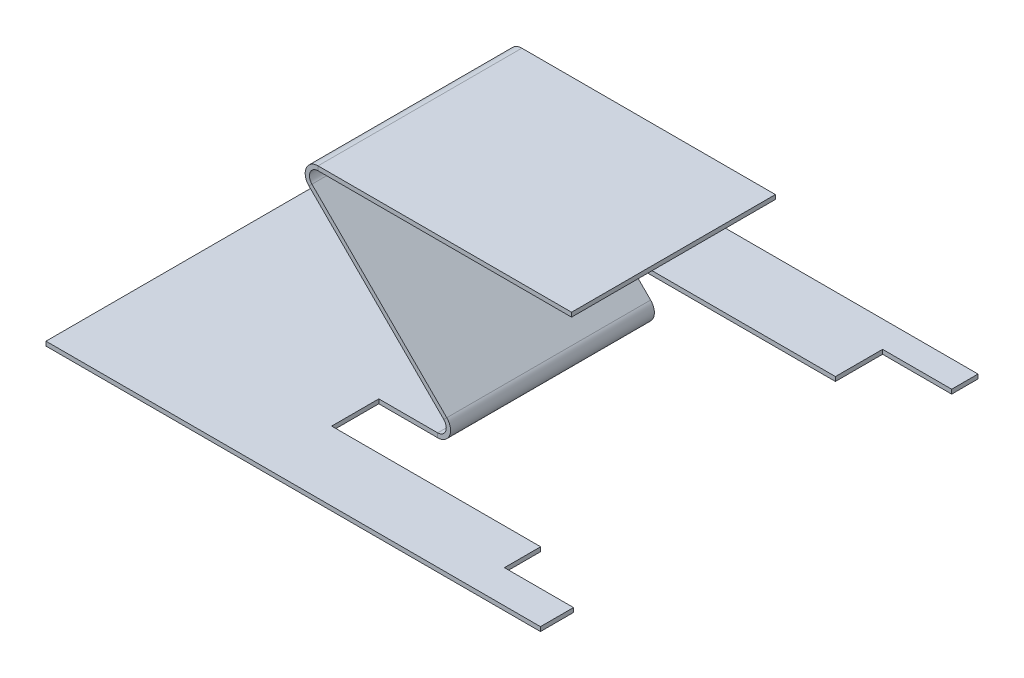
ISO-10303-21;
HEADER;
FILE_DESCRIPTION(('STEP AP214'),'2;1');
FILE_NAME('part.step','',(''),(''),'','','');
FILE_SCHEMA(('AUTOMOTIVE_DESIGN { 1 0 10303 214 1 1 1 1 }'));
ENDSEC;
DATA;
#1=APPLICATION_CONTEXT('core data for automotive mechanical design processes');
#2=APPLICATION_PROTOCOL_DEFINITION('international standard','automotive_design',2000,#1);
#3=PRODUCT_CONTEXT('',#1,'mechanical');
#4=PRODUCT('Part','Part','',(#3));
#5=PRODUCT_RELATED_PRODUCT_CATEGORY('part','',(#4));
#6=PRODUCT_DEFINITION_FORMATION('','',#4);
#7=PRODUCT_DEFINITION_CONTEXT('part definition',#1,'design');
#8=PRODUCT_DEFINITION('design','',#6,#7);
#9=PRODUCT_DEFINITION_SHAPE('','',#8);
#10=(LENGTH_UNIT() NAMED_UNIT(*) SI_UNIT(.MILLI.,.METRE.));
#11=(NAMED_UNIT(*) PLANE_ANGLE_UNIT() SI_UNIT($,.RADIAN.));
#12=(NAMED_UNIT(*) SI_UNIT($,.STERADIAN.) SOLID_ANGLE_UNIT());
#13=UNCERTAINTY_MEASURE_WITH_UNIT(LENGTH_MEASURE(1.E-05),#10,'distance_accuracy_value','');
#14=(GEOMETRIC_REPRESENTATION_CONTEXT(3) GLOBAL_UNCERTAINTY_ASSIGNED_CONTEXT((#13)) GLOBAL_UNIT_ASSIGNED_CONTEXT((#10,
#11,#12)) REPRESENTATION_CONTEXT('',''));
#15=CARTESIAN_POINT('',(0.,0.,0.));
#16=DIRECTION('',(0.,0.,1.));
#17=DIRECTION('',(1.,0.,0.));
#18=AXIS2_PLACEMENT_3D('',#15,#16,#17);
#19=CARTESIAN_POINT('',(24.2169050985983,36.4189178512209,41.4697311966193));
#20=DIRECTION('',(0.707106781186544,0.707106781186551,0.));
#21=DIRECTION('',(0.,0.,-1.));
#22=AXIS2_PLACEMENT_3D('',#19,#20,#21);
#23=PLANE('',#22);
#24=DIRECTION('',(-0.707106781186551,0.707106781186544,0.));
#25=VECTOR('',#24,1.);
#26=CARTESIAN_POINT('',(70.1039701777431,-9.46814722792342,22.0110102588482));
#27=LINE('',#26,#25);
#28=CARTESIAN_POINT('',(56.2216093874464,4.4142135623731,22.0110102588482));
#29=VERTEX_POINT('',#28);
#30=CARTESIAN_POINT('',(24.7571432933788,35.8786796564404,22.0110102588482));
#31=VERTEX_POINT('',#30);
#32=EDGE_CURVE('E43',#29,#31,#27,.T.);
#33=ORIENTED_EDGE('',*,*,#32,.T.);
#34=DIRECTION('',(0.,0.,-1.));
#35=VECTOR('',#34,1.);
#36=CARTESIAN_POINT('',(24.7571432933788,35.8786796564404,41.4697311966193));
#37=LINE('',#36,#35);
#38=CARTESIAN_POINT('',(24.7571432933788,35.8786796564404,-25.5547520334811));
#39=VERTEX_POINT('',#38);
#40=EDGE_CURVE('E398',#31,#39,#37,.T.);
#41=ORIENTED_EDGE('',*,*,#40,.T.);
#42=DIRECTION('',(0.707106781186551,-0.707106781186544,0.));
#43=VECTOR('',#42,1.);
#44=CARTESIAN_POINT('',(17.5497955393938,43.0860274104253,-25.5547520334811));
#45=LINE('',#44,#43);
#46=CARTESIAN_POINT('',(56.2216093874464,4.4142135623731,-25.5547520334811));
#47=VERTEX_POINT('',#46);
#48=EDGE_CURVE('E390',#39,#47,#45,.T.);
#49=ORIENTED_EDGE('',*,*,#48,.T.);
#50=DIRECTION('',(0.,0.,-1.));
#51=VECTOR('',#50,1.);
#52=CARTESIAN_POINT('',(56.2216093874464,4.41421356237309,41.4697311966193));
#53=LINE('',#52,#51);
#54=EDGE_CURVE('E386',#29,#47,#53,.T.);
#55=ORIENTED_EDGE('',*,*,#54,.F.);
#56=EDGE_LOOP('',(#33,#41,#49,#55));
#57=FACE_BOUND('',#56,.T.);
#58=ADVANCED_FACE('F39',(#57),#23,.F.);
#59=CARTESIAN_POINT('',(17.5497955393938,43.0860274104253,-25.5547520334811));
#60=DIRECTION('',(0.,0.,1.));
#61=DIRECTION('',(-0.707106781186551,0.707106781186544,0.));
#62=AXIS2_PLACEMENT_3D('',#59,#60,#61);
#63=PLANE('',#62);
#64=ORIENTED_EDGE('',*,*,#48,.F.);
#65=DIRECTION('',(0.707106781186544,0.707106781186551,0.));
#66=VECTOR('',#65,1.);
#67=CARTESIAN_POINT('',(24.7571432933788,35.8786796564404,-25.5547520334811));
#68=LINE('',#67,#66);
#69=CARTESIAN_POINT('',(25.4642500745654,36.5857864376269,-25.5547520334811));
#70=VERTEX_POINT('',#69);
#71=EDGE_CURVE('E12',#39,#70,#68,.T.);
#72=ORIENTED_EDGE('',*,*,#71,.T.);
#73=DIRECTION('',(0.707106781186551,-0.707106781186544,0.));
#74=VECTOR('',#73,1.);
#75=CARTESIAN_POINT('',(18.2569023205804,43.7931341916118,-25.5547520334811));
#76=LINE('',#75,#74);
#77=CARTESIAN_POINT('',(56.9287161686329,5.12132034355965,-25.5547520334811));
#78=VERTEX_POINT('',#77);
#79=EDGE_CURVE('E405',#70,#78,#76,.T.);
#80=ORIENTED_EDGE('',*,*,#79,.T.);
#81=DIRECTION('',(0.707106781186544,0.707106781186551,0.));
#82=VECTOR('',#81,1.);
#83=CARTESIAN_POINT('',(56.2216093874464,4.4142135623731,-25.5547520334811));
#84=LINE('',#83,#82);
#85=EDGE_CURVE('E389',#47,#78,#84,.T.);
#86=ORIENTED_EDGE('',*,*,#85,.F.);
#87=EDGE_LOOP('',(#64,#72,#80,#86));
#88=FACE_BOUND('',#87,.T.);
#89=ADVANCED_FACE('F41',(#88),#63,.F.);
#90=CARTESIAN_POINT('',(70.1039701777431,-9.46814722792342,22.0110102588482));
#91=DIRECTION('',(0.,0.,-1.));
#92=DIRECTION('',(0.707106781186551,-0.707106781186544,0.));
#93=AXIS2_PLACEMENT_3D('',#90,#91,#92);
#94=PLANE('',#93);
#95=DIRECTION('',(-0.707106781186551,0.707106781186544,0.));
#96=VECTOR('',#95,1.);
#97=CARTESIAN_POINT('',(70.8110769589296,-8.76104044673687,22.0110102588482));
#98=LINE('',#97,#96);
#99=CARTESIAN_POINT('',(56.928716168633,5.12132034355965,22.0110102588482));
#100=VERTEX_POINT('',#99);
#101=CARTESIAN_POINT('',(25.4642500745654,36.5857864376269,22.0110102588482));
#102=VERTEX_POINT('',#101);
#103=EDGE_CURVE('E62',#100,#102,#98,.T.);
#104=ORIENTED_EDGE('',*,*,#103,.T.);
#105=DIRECTION('',(-0.707106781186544,-0.707106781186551,0.));
#106=VECTOR('',#105,1.);
#107=CARTESIAN_POINT('',(24.7571432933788,35.8786796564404,22.0110102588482));
#108=LINE('',#107,#106);
#109=EDGE_CURVE('E401',#102,#31,#108,.T.);
#110=ORIENTED_EDGE('',*,*,#109,.T.);
#111=ORIENTED_EDGE('',*,*,#32,.F.);
#112=DIRECTION('',(-0.707106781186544,-0.707106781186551,0.));
#113=VECTOR('',#112,1.);
#114=CARTESIAN_POINT('',(56.2216093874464,4.4142135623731,22.0110102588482));
#115=LINE('',#114,#113);
#116=EDGE_CURVE('E395',#100,#29,#115,.T.);
#117=ORIENTED_EDGE('',*,*,#116,.F.);
#118=EDGE_LOOP('',(#104,#110,#111,#117));
#119=FACE_BOUND('',#118,.T.);
#120=ADVANCED_FACE('F414',(#119),#94,.F.);
#121=CARTESIAN_POINT('',(24.9240118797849,37.1260246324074,41.4697311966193));
#122=DIRECTION('',(0.707106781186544,0.707106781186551,0.));
#123=DIRECTION('',(0.,0.,-1.));
#124=AXIS2_PLACEMENT_3D('',#121,#122,#123);
#125=PLANE('',#124);
#126=DIRECTION('',(0.,0.,-1.));
#127=VECTOR('',#126,1.);
#128=CARTESIAN_POINT('',(25.4642500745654,36.5857864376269,41.4697311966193));
#129=LINE('',#128,#127);
#130=EDGE_CURVE('E48',#102,#70,#129,.T.);
#131=ORIENTED_EDGE('',*,*,#130,.F.);
#132=ORIENTED_EDGE('',*,*,#103,.F.);
#133=DIRECTION('',(0.,0.,-1.));
#134=VECTOR('',#133,1.);
#135=CARTESIAN_POINT('',(56.928716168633,5.12132034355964,41.4697311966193));
#136=LINE('',#135,#134);
#137=EDGE_CURVE('E393',#100,#78,#136,.T.);
#138=ORIENTED_EDGE('',*,*,#137,.T.);
#139=ORIENTED_EDGE('',*,*,#79,.F.);
#140=EDGE_LOOP('',(#131,#132,#138,#139));
#141=FACE_BOUND('',#140,.T.);
#142=ADVANCED_FACE('F449',(#141),#125,.T.);
#143=CARTESIAN_POINT('',(41.0652591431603,1.,33.0179635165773));
#144=DIRECTION('',(-1.,0.,0.));
#145=DIRECTION('',(0.,0.,1.));
#146=AXIS2_PLACEMENT_3D('',#143,#144,#145);
#147=PLANE('',#146);
#148=DIRECTION('',(0.,0.,-1.));
#149=VECTOR('',#148,1.);
#150=CARTESIAN_POINT('',(41.0652591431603,0.,33.0179635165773));
#151=LINE('',#150,#149);
#152=CARTESIAN_POINT('',(41.0652591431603,0.,33.0179635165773));
#153=VERTEX_POINT('',#152);
#154=CARTESIAN_POINT('',(41.0652591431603,0.,22.0110102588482));
#155=VERTEX_POINT('',#154);
#156=EDGE_CURVE('E383',#153,#155,#151,.T.);
#157=ORIENTED_EDGE('',*,*,#156,.T.);
#158=DIRECTION('',(0.,-1.,0.));
#159=VECTOR('',#158,1.);
#160=CARTESIAN_POINT('',(41.0652591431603,1.,22.0110102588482));
#161=LINE('',#160,#159);
#162=CARTESIAN_POINT('',(41.0652591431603,1.,22.0110102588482));
#163=VERTEX_POINT('',#162);
#164=EDGE_CURVE('E270',#163,#155,#161,.T.);
#165=ORIENTED_EDGE('',*,*,#164,.F.);
#166=DIRECTION('',(0.,0.,-1.));
#167=VECTOR('',#166,1.);
#168=CARTESIAN_POINT('',(41.0652591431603,1.,33.0179635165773));
#169=LINE('',#168,#167);
#170=CARTESIAN_POINT('',(41.0652591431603,1.,33.0179635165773));
#171=VERTEX_POINT('',#170);
#172=EDGE_CURVE('E284',#171,#163,#169,.T.);
#173=ORIENTED_EDGE('',*,*,#172,.F.);
#174=DIRECTION('',(0.,-1.,0.));
#175=VECTOR('',#174,1.);
#176=CARTESIAN_POINT('',(41.0652591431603,1.,33.0179635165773));
#177=LINE('',#176,#175);
#178=EDGE_CURVE('E380',#171,#153,#177,.T.);
#179=ORIENTED_EDGE('',*,*,#178,.T.);
#180=EDGE_LOOP('',(#157,#165,#173,#179));
#181=FACE_BOUND('',#180,.T.);
#182=ADVANCED_FACE('F451',(#181),#147,.F.);
#183=CARTESIAN_POINT('',(89.8362298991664,1.,33.0179635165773));
#184=DIRECTION('',(0.,0.,1.));
#185=DIRECTION('',(1.,0.,0.));
#186=AXIS2_PLACEMENT_3D('',#183,#184,#185);
#187=PLANE('',#186);
#188=DIRECTION('',(-1.,0.,0.));
#189=VECTOR('',#188,1.);
#190=CARTESIAN_POINT('',(89.8362298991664,0.,33.0179635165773));
#191=LINE('',#190,#189);
#192=CARTESIAN_POINT('',(89.8362298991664,0.,33.0179635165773));
#193=VERTEX_POINT('',#192);
#194=EDGE_CURVE('E378',#193,#153,#191,.T.);
#195=ORIENTED_EDGE('',*,*,#194,.T.);
#196=ORIENTED_EDGE('',*,*,#178,.F.);
#197=DIRECTION('',(-1.,0.,0.));
#198=VECTOR('',#197,1.);
#199=CARTESIAN_POINT('',(89.8362298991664,1.,33.0179635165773));
#200=LINE('',#199,#198);
#201=CARTESIAN_POINT('',(89.8362298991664,1.,33.0179635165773));
#202=VERTEX_POINT('',#201);
#203=EDGE_CURVE('E286',#202,#171,#200,.T.);
#204=ORIENTED_EDGE('',*,*,#203,.F.);
#205=DIRECTION('',(0.,-1.,0.));
#206=VECTOR('',#205,1.);
#207=CARTESIAN_POINT('',(89.8362298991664,1.,33.0179635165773));
#208=LINE('',#207,#206);
#209=EDGE_CURVE('E375',#202,#193,#208,.T.);
#210=ORIENTED_EDGE('',*,*,#209,.T.);
#211=EDGE_LOOP('',(#195,#196,#204,#210));
#212=FACE_BOUND('',#211,.T.);
#213=ADVANCED_FACE('F455',(#212),#187,.F.);
#214=CARTESIAN_POINT('',(89.8362298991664,1.,33.0179635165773));
#215=DIRECTION('',(-1.,0.,0.));
#216=DIRECTION('',(0.,0.,1.));
#217=AXIS2_PLACEMENT_3D('',#214,#215,#216);
#218=PLANE('',#217);
#219=DIRECTION('',(0.,0.,-1.));
#220=VECTOR('',#219,1.);
#221=CARTESIAN_POINT('',(89.8362298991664,0.,33.0179635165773));
#222=LINE('',#221,#220);
#223=CARTESIAN_POINT('',(89.8362298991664,0.,41.4697311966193));
#224=VERTEX_POINT('',#223);
#225=EDGE_CURVE('E373',#224,#193,#222,.T.);
#226=ORIENTED_EDGE('',*,*,#225,.T.);
#227=ORIENTED_EDGE('',*,*,#209,.F.);
#228=DIRECTION('',(0.,0.,-1.));
#229=VECTOR('',#228,1.);
#230=CARTESIAN_POINT('',(89.8362298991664,1.,33.0179635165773));
#231=LINE('',#230,#229);
#232=CARTESIAN_POINT('',(89.8362298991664,1.,41.4697311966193));
#233=VERTEX_POINT('',#232);
#234=EDGE_CURVE('E288',#233,#202,#231,.T.);
#235=ORIENTED_EDGE('',*,*,#234,.F.);
#236=DIRECTION('',(0.,-1.,0.));
#237=VECTOR('',#236,1.);
#238=CARTESIAN_POINT('',(89.8362298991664,1.,41.4697311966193));
#239=LINE('',#238,#237);
#240=EDGE_CURVE('E370',#233,#224,#239,.T.);
#241=ORIENTED_EDGE('',*,*,#240,.T.);
#242=EDGE_LOOP('',(#226,#227,#235,#241));
#243=FACE_BOUND('',#242,.T.);
#244=ADVANCED_FACE('F500',(#243),#218,.F.);
#245=CARTESIAN_POINT('',(89.8362298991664,1.,41.4697311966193));
#246=DIRECTION('',(0.,0.,1.));
#247=DIRECTION('',(1.,0.,0.));
#248=AXIS2_PLACEMENT_3D('',#245,#246,#247);
#249=PLANE('',#248);
#250=DIRECTION('',(-1.,0.,0.));
#251=VECTOR('',#250,1.);
#252=CARTESIAN_POINT('',(89.8362298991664,0.,41.4697311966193));
#253=LINE('',#252,#251);
#254=CARTESIAN_POINT('',(105.959368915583,0.,41.4697311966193));
#255=VERTEX_POINT('',#254);
#256=EDGE_CURVE('E368',#255,#224,#253,.T.);
#257=ORIENTED_EDGE('',*,*,#256,.T.);
#258=ORIENTED_EDGE('',*,*,#240,.F.);
#259=DIRECTION('',(-1.,0.,0.));
#260=VECTOR('',#259,1.);
#261=CARTESIAN_POINT('',(89.8362298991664,1.,41.4697311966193));
#262=LINE('',#261,#260);
#263=CARTESIAN_POINT('',(105.959368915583,1.,41.4697311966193));
#264=VERTEX_POINT('',#263);
#265=EDGE_CURVE('E290',#264,#233,#262,.T.);
#266=ORIENTED_EDGE('',*,*,#265,.F.);
#267=DIRECTION('',(0.,-1.,0.));
#268=VECTOR('',#267,1.);
#269=CARTESIAN_POINT('',(105.959368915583,1.,41.4697311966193));
#270=LINE('',#269,#268);
#271=EDGE_CURVE('E365',#264,#255,#270,.T.);
#272=ORIENTED_EDGE('',*,*,#271,.T.);
#273=EDGE_LOOP('',(#257,#258,#266,#272));
#274=FACE_BOUND('',#273,.T.);
#275=ADVANCED_FACE('F504',(#274),#249,.F.);
#276=CARTESIAN_POINT('',(105.959368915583,1.,49.1848728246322));
#277=DIRECTION('',(-1.,0.,0.));
#278=DIRECTION('',(0.,0.,1.));
#279=AXIS2_PLACEMENT_3D('',#276,#277,#278);
#280=PLANE('',#279);
#281=DIRECTION('',(0.,0.,-1.));
#282=VECTOR('',#281,1.);
#283=CARTESIAN_POINT('',(105.959368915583,0.,49.1848728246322));
#284=LINE('',#283,#282);
#285=CARTESIAN_POINT('',(105.959368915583,0.,49.1848728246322));
#286=VERTEX_POINT('',#285);
#287=EDGE_CURVE('E362',#286,#255,#284,.T.);
#288=ORIENTED_EDGE('',*,*,#287,.T.);
#289=ORIENTED_EDGE('',*,*,#271,.F.);
#290=DIRECTION('',(0.,0.,-1.));
#291=VECTOR('',#290,1.);
#292=CARTESIAN_POINT('',(105.959368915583,1.,49.1848728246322));
#293=LINE('',#292,#291);
#294=CARTESIAN_POINT('',(105.959368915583,1.,49.1848728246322));
#295=VERTEX_POINT('',#294);
#296=EDGE_CURVE('E292',#295,#264,#293,.T.);
#297=ORIENTED_EDGE('',*,*,#296,.F.);
#298=DIRECTION('',(0.,-1.,0.));
#299=VECTOR('',#298,1.);
#300=CARTESIAN_POINT('',(105.959368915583,1.,49.1848728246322));
#301=LINE('',#300,#299);
#302=EDGE_CURVE('E359',#295,#286,#301,.T.);
#303=ORIENTED_EDGE('',*,*,#302,.T.);
#304=EDGE_LOOP('',(#288,#289,#297,#303));
#305=FACE_BOUND('',#304,.T.);
#306=ADVANCED_FACE('F508',(#305),#280,.F.);
#307=CARTESIAN_POINT('',(105.959368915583,1.,49.1848728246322));
#308=DIRECTION('',(0.,0.,-1.));
#309=DIRECTION('',(-1.,0.,0.));
#310=AXIS2_PLACEMENT_3D('',#307,#308,#309);
#311=PLANE('',#310);
#312=DIRECTION('',(1.,0.,0.));
#313=VECTOR('',#312,1.);
#314=CARTESIAN_POINT('',(105.959368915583,0.,49.1848728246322));
#315=LINE('',#314,#313);
#316=CARTESIAN_POINT('',(-9.4287167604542,0.,49.1848728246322));
#317=VERTEX_POINT('',#316);
#318=EDGE_CURVE('E357',#317,#286,#315,.T.);
#319=ORIENTED_EDGE('',*,*,#318,.T.);
#320=ORIENTED_EDGE('',*,*,#302,.F.);
#321=DIRECTION('',(1.,0.,0.));
#322=VECTOR('',#321,1.);
#323=CARTESIAN_POINT('',(105.959368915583,1.,49.1848728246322));
#324=LINE('',#323,#322);
#325=CARTESIAN_POINT('',(-9.4287167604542,1.,49.1848728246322));
#326=VERTEX_POINT('',#325);
#327=EDGE_CURVE('E295',#326,#295,#324,.T.);
#328=ORIENTED_EDGE('',*,*,#327,.F.);
#329=DIRECTION('',(0.,-1.,0.));
#330=VECTOR('',#329,1.);
#331=CARTESIAN_POINT('',(-9.4287167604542,1.,49.1848728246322));
#332=LINE('',#331,#330);
#333=EDGE_CURVE('E354',#326,#317,#332,.T.);
#334=ORIENTED_EDGE('',*,*,#333,.T.);
#335=EDGE_LOOP('',(#319,#320,#328,#334));
#336=FACE_BOUND('',#335,.T.);
#337=ADVANCED_FACE('F512',(#336),#311,.F.);
#338=CARTESIAN_POINT('',(-9.4287167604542,1.,49.1848728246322));
#339=DIRECTION('',(1.,0.,0.));
#340=DIRECTION('',(0.,0.,-1.));
#341=AXIS2_PLACEMENT_3D('',#338,#339,#340);
#342=PLANE('',#341);
#343=DIRECTION('',(0.,0.,1.));
#344=VECTOR('',#343,1.);
#345=CARTESIAN_POINT('',(-9.4287167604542,0.,49.1848728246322));
#346=LINE('',#345,#344);
#347=CARTESIAN_POINT('',(-9.4287167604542,0.,-52.9251673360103));
#348=VERTEX_POINT('',#347);
#349=EDGE_CURVE('E352',#348,#317,#346,.T.);
#350=ORIENTED_EDGE('',*,*,#349,.T.);
#351=ORIENTED_EDGE('',*,*,#333,.F.);
#352=DIRECTION('',(0.,0.,1.));
#353=VECTOR('',#352,1.);
#354=CARTESIAN_POINT('',(-9.4287167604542,1.,49.1848728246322));
#355=LINE('',#354,#353);
#356=CARTESIAN_POINT('',(-9.4287167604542,1.,-52.9251673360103));
#357=VERTEX_POINT('',#356);
#358=EDGE_CURVE('E297',#357,#326,#355,.T.);
#359=ORIENTED_EDGE('',*,*,#358,.F.);
#360=DIRECTION('',(0.,-1.,0.));
#361=VECTOR('',#360,1.);
#362=CARTESIAN_POINT('',(-9.4287167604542,1.,-52.9251673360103));
#363=LINE('',#362,#361);
#364=EDGE_CURVE('E349',#357,#348,#363,.T.);
#365=ORIENTED_EDGE('',*,*,#364,.T.);
#366=EDGE_LOOP('',(#350,#351,#359,#365));
#367=FACE_BOUND('',#366,.T.);
#368=ADVANCED_FACE('F516',(#367),#342,.F.);
#369=CARTESIAN_POINT('',(105.959368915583,1.,-52.9251673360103));
#370=DIRECTION('',(0.,0.,1.));
#371=DIRECTION('',(1.,0.,0.));
#372=AXIS2_PLACEMENT_3D('',#369,#370,#371);
#373=PLANE('',#372);
#374=DIRECTION('',(-1.,0.,0.));
#375=VECTOR('',#374,1.);
#376=CARTESIAN_POINT('',(105.959368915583,0.,-52.9251673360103));
#377=LINE('',#376,#375);
#378=CARTESIAN_POINT('',(105.959368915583,0.,-52.9251673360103));
#379=VERTEX_POINT('',#378);
#380=EDGE_CURVE('E347',#379,#348,#377,.T.);
#381=ORIENTED_EDGE('',*,*,#380,.T.);
#382=ORIENTED_EDGE('',*,*,#364,.F.);
#383=DIRECTION('',(-1.,0.,0.));
#384=VECTOR('',#383,1.);
#385=CARTESIAN_POINT('',(105.959368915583,1.,-52.9251673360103));
#386=LINE('',#385,#384);
#387=CARTESIAN_POINT('',(105.959368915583,1.,-52.9251673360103));
#388=VERTEX_POINT('',#387);
#389=EDGE_CURVE('E299',#388,#357,#386,.T.);
#390=ORIENTED_EDGE('',*,*,#389,.F.);
#391=DIRECTION('',(0.,-1.,0.));
#392=VECTOR('',#391,1.);
#393=CARTESIAN_POINT('',(105.959368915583,1.,-52.9251673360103));
#394=LINE('',#393,#392);
#395=EDGE_CURVE('E344',#388,#379,#394,.T.);
#396=ORIENTED_EDGE('',*,*,#395,.T.);
#397=EDGE_LOOP('',(#381,#382,#390,#396));
#398=FACE_BOUND('',#397,.T.);
#399=ADVANCED_FACE('F520',(#398),#373,.F.);
#400=CARTESIAN_POINT('',(105.959368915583,1.,-46.7824476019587));
#401=DIRECTION('',(-1.,0.,0.));
#402=DIRECTION('',(0.,0.,1.));
#403=AXIS2_PLACEMENT_3D('',#400,#401,#402);
#404=PLANE('',#403);
#405=DIRECTION('',(0.,0.,-1.));
#406=VECTOR('',#405,1.);
#407=CARTESIAN_POINT('',(105.959368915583,0.,-46.7824476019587));
#408=LINE('',#407,#406);
#409=CARTESIAN_POINT('',(105.959368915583,0.,-46.7824476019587));
#410=VERTEX_POINT('',#409);
#411=EDGE_CURVE('E342',#410,#379,#408,.T.);
#412=ORIENTED_EDGE('',*,*,#411,.T.);
#413=ORIENTED_EDGE('',*,*,#395,.F.);
#414=DIRECTION('',(0.,0.,-1.));
#415=VECTOR('',#414,1.);
#416=CARTESIAN_POINT('',(105.959368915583,1.,-46.7824476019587));
#417=LINE('',#416,#415);
#418=CARTESIAN_POINT('',(105.959368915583,1.,-46.7824476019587));
#419=VERTEX_POINT('',#418);
#420=EDGE_CURVE('E301',#419,#388,#417,.T.);
#421=ORIENTED_EDGE('',*,*,#420,.F.);
#422=DIRECTION('',(0.,-1.,0.));
#423=VECTOR('',#422,1.);
#424=CARTESIAN_POINT('',(105.959368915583,1.,-46.7824476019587));
#425=LINE('',#424,#423);
#426=EDGE_CURVE('E339',#419,#410,#425,.T.);
#427=ORIENTED_EDGE('',*,*,#426,.T.);
#428=EDGE_LOOP('',(#412,#413,#421,#427));
#429=FACE_BOUND('',#428,.T.);
#430=ADVANCED_FACE('F524',(#429),#404,.F.);
#431=CARTESIAN_POINT('',(89.8362298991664,1.,-46.7824476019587));
#432=DIRECTION('',(0.,0.,-1.));
#433=DIRECTION('',(-1.,0.,0.));
#434=AXIS2_PLACEMENT_3D('',#431,#432,#433);
#435=PLANE('',#434);
#436=DIRECTION('',(1.,0.,0.));
#437=VECTOR('',#436,1.);
#438=CARTESIAN_POINT('',(89.8362298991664,0.,-46.7824476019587));
#439=LINE('',#438,#437);
#440=CARTESIAN_POINT('',(89.8362298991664,0.,-46.7824476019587));
#441=VERTEX_POINT('',#440);
#442=EDGE_CURVE('E337',#441,#410,#439,.T.);
#443=ORIENTED_EDGE('',*,*,#442,.T.);
#444=ORIENTED_EDGE('',*,*,#426,.F.);
#445=DIRECTION('',(1.,0.,0.));
#446=VECTOR('',#445,1.);
#447=CARTESIAN_POINT('',(89.8362298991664,1.,-46.7824476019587));
#448=LINE('',#447,#446);
#449=CARTESIAN_POINT('',(89.8362298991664,1.,-46.7824476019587));
#450=VERTEX_POINT('',#449);
#451=EDGE_CURVE('E303',#450,#419,#448,.T.);
#452=ORIENTED_EDGE('',*,*,#451,.F.);
#453=DIRECTION('',(0.,-1.,0.));
#454=VECTOR('',#453,1.);
#455=CARTESIAN_POINT('',(89.8362298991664,1.,-46.7824476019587));
#456=LINE('',#455,#454);
#457=EDGE_CURVE('E334',#450,#441,#456,.T.);
#458=ORIENTED_EDGE('',*,*,#457,.T.);
#459=EDGE_LOOP('',(#443,#444,#452,#458));
#460=FACE_BOUND('',#459,.T.);
#461=ADVANCED_FACE('F528',(#460),#435,.F.);
#462=CARTESIAN_POINT('',(89.8362298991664,1.,-35.7754943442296));
#463=DIRECTION('',(-1.,0.,0.));
#464=DIRECTION('',(0.,0.,1.));
#465=AXIS2_PLACEMENT_3D('',#462,#463,#464);
#466=PLANE('',#465);
#467=DIRECTION('',(0.,0.,-1.));
#468=VECTOR('',#467,1.);
#469=CARTESIAN_POINT('',(89.8362298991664,0.,-35.7754943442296));
#470=LINE('',#469,#468);
#471=CARTESIAN_POINT('',(89.8362298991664,0.,-35.7754943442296));
#472=VERTEX_POINT('',#471);
#473=EDGE_CURVE('E332',#472,#441,#470,.T.);
#474=ORIENTED_EDGE('',*,*,#473,.T.);
#475=ORIENTED_EDGE('',*,*,#457,.F.);
#476=DIRECTION('',(0.,0.,-1.));
#477=VECTOR('',#476,1.);
#478=CARTESIAN_POINT('',(89.8362298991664,1.,-35.7754943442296));
#479=LINE('',#478,#477);
#480=CARTESIAN_POINT('',(89.8362298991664,1.,-35.7754943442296));
#481=VERTEX_POINT('',#480);
#482=EDGE_CURVE('E305',#481,#450,#479,.T.);
#483=ORIENTED_EDGE('',*,*,#482,.F.);
#484=DIRECTION('',(0.,-1.,0.));
#485=VECTOR('',#484,1.);
#486=CARTESIAN_POINT('',(89.8362298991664,1.,-35.7754943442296));
#487=LINE('',#486,#485);
#488=EDGE_CURVE('E329',#481,#472,#487,.T.);
#489=ORIENTED_EDGE('',*,*,#488,.T.);
#490=EDGE_LOOP('',(#474,#475,#483,#489));
#491=FACE_BOUND('',#490,.T.);
#492=ADVANCED_FACE('F532',(#491),#466,.F.);
#493=CARTESIAN_POINT('',(41.0652591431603,1.,-35.7754943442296));
#494=DIRECTION('',(0.,0.,-1.));
#495=DIRECTION('',(-1.,0.,0.));
#496=AXIS2_PLACEMENT_3D('',#493,#494,#495);
#497=PLANE('',#496);
#498=DIRECTION('',(1.,0.,0.));
#499=VECTOR('',#498,1.);
#500=CARTESIAN_POINT('',(41.0652591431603,0.,-35.7754943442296));
#501=LINE('',#500,#499);
#502=CARTESIAN_POINT('',(41.0652591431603,0.,-35.7754943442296));
#503=VERTEX_POINT('',#502);
#504=EDGE_CURVE('E327',#503,#472,#501,.T.);
#505=ORIENTED_EDGE('',*,*,#504,.T.);
#506=ORIENTED_EDGE('',*,*,#488,.F.);
#507=DIRECTION('',(1.,0.,0.));
#508=VECTOR('',#507,1.);
#509=CARTESIAN_POINT('',(41.0652591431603,1.,-35.7754943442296));
#510=LINE('',#509,#508);
#511=CARTESIAN_POINT('',(41.0652591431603,1.,-35.7754943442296));
#512=VERTEX_POINT('',#511);
#513=EDGE_CURVE('E307',#512,#481,#510,.T.);
#514=ORIENTED_EDGE('',*,*,#513,.F.);
#515=DIRECTION('',(0.,-1.,0.));
#516=VECTOR('',#515,1.);
#517=CARTESIAN_POINT('',(41.0652591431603,1.,-35.7754943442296));
#518=LINE('',#517,#516);
#519=EDGE_CURVE('E324',#512,#503,#518,.T.);
#520=ORIENTED_EDGE('',*,*,#519,.T.);
#521=EDGE_LOOP('',(#505,#506,#514,#520));
#522=FACE_BOUND('',#521,.T.);
#523=ADVANCED_FACE('F536',(#522),#497,.F.);
#524=CARTESIAN_POINT('',(41.0652591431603,1.,-25.5547520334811));
#525=DIRECTION('',(-1.,0.,0.));
#526=DIRECTION('',(0.,0.,1.));
#527=AXIS2_PLACEMENT_3D('',#524,#525,#526);
#528=PLANE('',#527);
#529=DIRECTION('',(0.,0.,-1.));
#530=VECTOR('',#529,1.);
#531=CARTESIAN_POINT('',(41.0652591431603,0.,-25.5547520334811));
#532=LINE('',#531,#530);
#533=CARTESIAN_POINT('',(41.0652591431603,0.,-25.5547520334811));
#534=VERTEX_POINT('',#533);
#535=EDGE_CURVE('E322',#534,#503,#532,.T.);
#536=ORIENTED_EDGE('',*,*,#535,.T.);
#537=ORIENTED_EDGE('',*,*,#519,.F.);
#538=DIRECTION('',(0.,0.,-1.));
#539=VECTOR('',#538,1.);
#540=CARTESIAN_POINT('',(41.0652591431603,1.,-25.5547520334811));
#541=LINE('',#540,#539);
#542=CARTESIAN_POINT('',(41.0652591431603,1.,-25.5547520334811));
#543=VERTEX_POINT('',#542);
#544=EDGE_CURVE('E309',#543,#512,#541,.T.);
#545=ORIENTED_EDGE('',*,*,#544,.F.);
#546=DIRECTION('',(0.,-1.,0.));
#547=VECTOR('',#546,1.);
#548=CARTESIAN_POINT('',(41.0652591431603,1.,-25.5547520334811));
#549=LINE('',#548,#547);
#550=EDGE_CURVE('E319',#543,#534,#549,.T.);
#551=ORIENTED_EDGE('',*,*,#550,.T.);
#552=EDGE_LOOP('',(#536,#537,#545,#551));
#553=FACE_BOUND('',#552,.T.);
#554=ADVANCED_FACE('F540',(#553),#528,.F.);
#555=CARTESIAN_POINT('',(105.959368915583,1.,41.4697311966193));
#556=DIRECTION('',(0.,-1.,0.));
#557=DIRECTION('',(0.,0.,-1.));
#558=AXIS2_PLACEMENT_3D('',#555,#556,#557);
#559=PLANE('',#558);
#560=DIRECTION('',(1.,0.,0.));
#561=VECTOR('',#560,1.);
#562=CARTESIAN_POINT('',(41.0652591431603,1.,22.0110102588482));
#563=LINE('',#562,#561);
#564=CARTESIAN_POINT('',(54.8073958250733,1.,22.0110102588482));
#565=VERTEX_POINT('',#564);
#566=EDGE_CURVE('E316',#163,#565,#563,.T.);
#567=ORIENTED_EDGE('',*,*,#566,.T.);
#568=DIRECTION('',(0.,0.,-1.));
#569=VECTOR('',#568,1.);
#570=CARTESIAN_POINT('',(54.8073958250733,1.,41.4697311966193));
#571=LINE('',#570,#569);
#572=CARTESIAN_POINT('',(54.8073958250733,0.999999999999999,-25.5547520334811));
#573=VERTEX_POINT('',#572);
#574=EDGE_CURVE('E313',#565,#573,#571,.T.);
#575=ORIENTED_EDGE('',*,*,#574,.T.);
#576=DIRECTION('',(-1.,0.,0.));
#577=VECTOR('',#576,1.);
#578=CARTESIAN_POINT('',(115.388085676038,1.,-25.5547520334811));
#579=LINE('',#578,#577);
#580=EDGE_CURVE('E311',#573,#543,#579,.T.);
#581=ORIENTED_EDGE('',*,*,#580,.T.);
#582=ORIENTED_EDGE('',*,*,#544,.T.);
#583=ORIENTED_EDGE('',*,*,#513,.T.);
#584=ORIENTED_EDGE('',*,*,#482,.T.);
#585=ORIENTED_EDGE('',*,*,#451,.T.);
#586=ORIENTED_EDGE('',*,*,#420,.T.);
#587=ORIENTED_EDGE('',*,*,#389,.T.);
#588=ORIENTED_EDGE('',*,*,#358,.T.);
#589=ORIENTED_EDGE('',*,*,#327,.T.);
#590=ORIENTED_EDGE('',*,*,#296,.T.);
#591=ORIENTED_EDGE('',*,*,#265,.T.);
#592=ORIENTED_EDGE('',*,*,#234,.T.);
#593=ORIENTED_EDGE('',*,*,#203,.T.);
#594=ORIENTED_EDGE('',*,*,#172,.T.);
#595=EDGE_LOOP('',(#567,#575,#581,#582,#583,#584,#585,#586,#587,#588,#589,#590,#591,#592,#593,#594));
#596=FACE_BOUND('',#595,.T.);
#597=ADVANCED_FACE('F482',(#596),#559,.F.);
#598=CARTESIAN_POINT('',(115.388085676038,1.,-25.5547520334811));
#599=DIRECTION('',(0.,0.,1.));
#600=DIRECTION('',(1.,0.,0.));
#601=AXIS2_PLACEMENT_3D('',#598,#599,#600);
#602=PLANE('',#601);
#603=ORIENTED_EDGE('',*,*,#580,.F.);
#604=DIRECTION('',(0.,-1.,0.));
#605=VECTOR('',#604,1.);
#606=CARTESIAN_POINT('',(54.8073958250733,1.,-25.5547520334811));
#607=LINE('',#606,#605);
#608=CARTESIAN_POINT('',(54.8073958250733,0.,-25.5547520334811));
#609=VERTEX_POINT('',#608);
#610=EDGE_CURVE('E281',#573,#609,#607,.T.);
#611=ORIENTED_EDGE('',*,*,#610,.T.);
#612=DIRECTION('',(-1.,0.,0.));
#613=VECTOR('',#612,1.);
#614=CARTESIAN_POINT('',(115.388085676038,0.,-25.5547520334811));
#615=LINE('',#614,#613);
#616=EDGE_CURVE('E279',#609,#534,#615,.T.);
#617=ORIENTED_EDGE('',*,*,#616,.T.);
#618=ORIENTED_EDGE('',*,*,#550,.F.);
#619=EDGE_LOOP('',(#603,#611,#617,#618));
#620=FACE_BOUND('',#619,.T.);
#621=ADVANCED_FACE('F477',(#620),#602,.F.);
#622=CARTESIAN_POINT('',(105.959368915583,0.,41.4697311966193));
#623=DIRECTION('',(0.,-1.,0.));
#624=DIRECTION('',(0.,0.,-1.));
#625=AXIS2_PLACEMENT_3D('',#622,#623,#624);
#626=PLANE('',#625);
#627=DIRECTION('',(0.,0.,-1.));
#628=VECTOR('',#627,1.);
#629=CARTESIAN_POINT('',(54.8073958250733,0.,41.4697311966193));
#630=LINE('',#629,#628);
#631=CARTESIAN_POINT('',(54.8073958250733,0.,22.0110102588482));
#632=VERTEX_POINT('',#631);
#633=EDGE_CURVE('E265',#632,#609,#630,.T.);
#634=ORIENTED_EDGE('',*,*,#633,.F.);
#635=DIRECTION('',(1.,0.,0.));
#636=VECTOR('',#635,1.);
#637=CARTESIAN_POINT('',(41.0652591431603,0.,22.0110102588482));
#638=LINE('',#637,#636);
#639=EDGE_CURVE('E276',#155,#632,#638,.T.);
#640=ORIENTED_EDGE('',*,*,#639,.F.);
#641=ORIENTED_EDGE('',*,*,#156,.F.);
#642=ORIENTED_EDGE('',*,*,#194,.F.);
#643=ORIENTED_EDGE('',*,*,#225,.F.);
#644=ORIENTED_EDGE('',*,*,#256,.F.);
#645=ORIENTED_EDGE('',*,*,#287,.F.);
#646=ORIENTED_EDGE('',*,*,#318,.F.);
#647=ORIENTED_EDGE('',*,*,#349,.F.);
#648=ORIENTED_EDGE('',*,*,#380,.F.);
#649=ORIENTED_EDGE('',*,*,#411,.F.);
#650=ORIENTED_EDGE('',*,*,#442,.F.);
#651=ORIENTED_EDGE('',*,*,#473,.F.);
#652=ORIENTED_EDGE('',*,*,#504,.F.);
#653=ORIENTED_EDGE('',*,*,#535,.F.);
#654=ORIENTED_EDGE('',*,*,#616,.F.);
#655=EDGE_LOOP('',(#634,#640,#641,#642,#643,#644,#645,#646,#647,#648,#649,#650,#651,#652,#653,#654));
#656=FACE_BOUND('',#655,.T.);
#657=ADVANCED_FACE('F470',(#656),#626,.T.);
#658=CARTESIAN_POINT('',(41.0652591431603,1.,22.0110102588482));
#659=DIRECTION('',(0.,0.,-1.));
#660=DIRECTION('',(-1.,0.,0.));
#661=AXIS2_PLACEMENT_3D('',#658,#659,#660);
#662=PLANE('',#661);
#663=ORIENTED_EDGE('',*,*,#639,.T.);
#664=DIRECTION('',(0.,1.,0.));
#665=VECTOR('',#664,1.);
#666=CARTESIAN_POINT('',(54.8073958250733,1.,22.0110102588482));
#667=LINE('',#666,#665);
#668=EDGE_CURVE('E273',#632,#565,#667,.T.);
#669=ORIENTED_EDGE('',*,*,#668,.T.);
#670=ORIENTED_EDGE('',*,*,#566,.F.);
#671=ORIENTED_EDGE('',*,*,#164,.T.);
#672=EDGE_LOOP('',(#663,#669,#670,#671));
#673=FACE_BOUND('',#672,.T.);
#674=ADVANCED_FACE('F446',(#673),#662,.F.);
#675=CARTESIAN_POINT('',(54.8073958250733,3.,22.0110102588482));
#676=DIRECTION('',(0.,0.,-1.));
#677=DIRECTION('',(-1.,0.,0.));
#678=AXIS2_PLACEMENT_3D('',#675,#676,#677);
#679=PLANE('',#678);
#680=ORIENTED_EDGE('',*,*,#668,.F.);
#681=CARTESIAN_POINT('',(54.8073958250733,3.,22.0110102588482));
#682=DIRECTION('',(0.,0.,-1.));
#683=DIRECTION('',(-1.,0.,0.));
#684=AXIS2_PLACEMENT_3D('',#681,#682,#683);
#685=CIRCLE('',#684,3.);
#686=EDGE_CURVE('E254',#632,#100,#685,.F.);
#687=ORIENTED_EDGE('',*,*,#686,.T.);
#688=ORIENTED_EDGE('',*,*,#116,.T.);
#689=CARTESIAN_POINT('',(54.8073958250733,3.,22.0110102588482));
#690=DIRECTION('',(0.,0.,1.));
#691=DIRECTION('',(1.,0.,0.));
#692=AXIS2_PLACEMENT_3D('',#689,#690,#691);
#693=CIRCLE('',#692,2.);
#694=EDGE_CURVE('E258',#565,#29,#693,.T.);
#695=ORIENTED_EDGE('',*,*,#694,.F.);
#696=EDGE_LOOP('',(#680,#687,#688,#695));
#697=FACE_BOUND('',#696,.T.);
#698=ADVANCED_FACE('F488',(#697),#679,.F.);
#699=CARTESIAN_POINT('',(54.8073958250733,3.,-25.5547520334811));
#700=DIRECTION('',(0.,0.,1.));
#701=DIRECTION('',(1.,0.,0.));
#702=AXIS2_PLACEMENT_3D('',#699,#700,#701);
#703=PLANE('',#702);
#704=ORIENTED_EDGE('',*,*,#85,.T.);
#705=CARTESIAN_POINT('',(54.8073958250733,3.,-25.5547520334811));
#706=DIRECTION('',(0.,0.,-1.));
#707=DIRECTION('',(-1.,0.,0.));
#708=AXIS2_PLACEMENT_3D('',#705,#706,#707);
#709=CIRCLE('',#708,3.);
#710=EDGE_CURVE('E262',#78,#609,#709,.T.);
#711=ORIENTED_EDGE('',*,*,#710,.T.);
#712=ORIENTED_EDGE('',*,*,#610,.F.);
#713=CARTESIAN_POINT('',(54.8073958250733,3.,-25.5547520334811));
#714=DIRECTION('',(0.,0.,-1.));
#715=DIRECTION('',(-1.,0.,0.));
#716=AXIS2_PLACEMENT_3D('',#713,#714,#715);
#717=CIRCLE('',#716,2.);
#718=EDGE_CURVE('E261',#47,#573,#717,.T.);
#719=ORIENTED_EDGE('',*,*,#718,.F.);
#720=EDGE_LOOP('',(#704,#711,#712,#719));
#721=FACE_BOUND('',#720,.T.);
#722=ADVANCED_FACE('F462',(#721),#703,.F.);
#723=CARTESIAN_POINT('',(54.8073958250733,3.,46.1676698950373));
#724=DIRECTION('',(0.,0.,-1.));
#725=DIRECTION('',(-1.,0.,0.));
#726=AXIS2_PLACEMENT_3D('',#723,#724,#725);
#727=CYLINDRICAL_SURFACE('',#726,2.);
#728=ORIENTED_EDGE('',*,*,#718,.T.);
#729=ORIENTED_EDGE('',*,*,#574,.F.);
#730=ORIENTED_EDGE('',*,*,#694,.T.);
#731=ORIENTED_EDGE('',*,*,#54,.T.);
#732=EDGE_LOOP('',(#728,#729,#730,#731));
#733=FACE_BOUND('',#732,.T.);
#734=ADVANCED_FACE('F480',(#733),#727,.F.);
#735=CARTESIAN_POINT('',(54.8073958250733,3.,46.1676698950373));
#736=DIRECTION('',(0.,0.,-1.));
#737=DIRECTION('',(-1.,0.,0.));
#738=AXIS2_PLACEMENT_3D('',#735,#736,#737);
#739=CYLINDRICAL_SURFACE('',#738,3.);
#740=ORIENTED_EDGE('',*,*,#710,.F.);
#741=ORIENTED_EDGE('',*,*,#137,.F.);
#742=ORIENTED_EDGE('',*,*,#686,.F.);
#743=ORIENTED_EDGE('',*,*,#633,.T.);
#744=EDGE_LOOP('',(#740,#741,#742,#743));
#745=FACE_BOUND('',#744,.T.);
#746=ADVANCED_FACE('F465',(#745),#739,.T.);
#747=CARTESIAN_POINT('',(26.8784636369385,38.,22.0110102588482));
#748=DIRECTION('',(0.,0.,1.));
#749=DIRECTION('',(1.,0.,0.));
#750=AXIS2_PLACEMENT_3D('',#747,#748,#749);
#751=PLANE('',#750);
#752=ORIENTED_EDGE('',*,*,#109,.F.);
#753=CARTESIAN_POINT('',(26.8784636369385,38.,22.0110102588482));
#754=DIRECTION('',(0.,0.,-1.));
#755=DIRECTION('',(0.,1.,0.));
#756=AXIS2_PLACEMENT_3D('',#753,#754,#755);
#757=CIRCLE('',#756,2.);
#758=CARTESIAN_POINT('',(26.8784636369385,40.,22.0110102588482));
#759=VERTEX_POINT('',#758);
#760=EDGE_CURVE('E231',#102,#759,#757,.T.);
#761=ORIENTED_EDGE('',*,*,#760,.T.);
#762=DIRECTION('',(0.,1.,0.));
#763=VECTOR('',#762,1.);
#764=CARTESIAN_POINT('',(26.8784636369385,41.,22.0110102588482));
#765=LINE('',#764,#763);
#766=CARTESIAN_POINT('',(26.8784636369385,41.,22.0110102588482));
#767=VERTEX_POINT('',#766);
#768=EDGE_CURVE('E241',#759,#767,#765,.T.);
#769=ORIENTED_EDGE('',*,*,#768,.T.);
#770=CARTESIAN_POINT('',(26.8784636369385,38.,22.0110102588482));
#771=DIRECTION('',(0.,0.,-1.));
#772=DIRECTION('',(-1.,0.,0.));
#773=AXIS2_PLACEMENT_3D('',#770,#771,#772);
#774=CIRCLE('',#773,3.);
#775=EDGE_CURVE('E247',#31,#767,#774,.T.);
#776=ORIENTED_EDGE('',*,*,#775,.F.);
#777=EDGE_LOOP('',(#752,#761,#769,#776));
#778=FACE_BOUND('',#777,.T.);
#779=ADVANCED_FACE('F416',(#778),#751,.T.);
#780=CARTESIAN_POINT('',(26.8784636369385,38.,-25.5547520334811));
#781=DIRECTION('',(0.,0.,-1.));
#782=DIRECTION('',(-1.,0.,0.));
#783=AXIS2_PLACEMENT_3D('',#780,#781,#782);
#784=PLANE('',#783);
#785=DIRECTION('',(0.,-1.,0.));
#786=VECTOR('',#785,1.);
#787=CARTESIAN_POINT('',(26.8784636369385,41.,-25.5547520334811));
#788=LINE('',#787,#786);
#789=CARTESIAN_POINT('',(26.8784636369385,41.,-25.5547520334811));
#790=VERTEX_POINT('',#789);
#791=CARTESIAN_POINT('',(26.8784636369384,40.,-25.5547520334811));
#792=VERTEX_POINT('',#791);
#793=EDGE_CURVE('E210',#790,#792,#788,.T.);
#794=ORIENTED_EDGE('',*,*,#793,.T.);
#795=CARTESIAN_POINT('',(26.8784636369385,38.,-25.5547520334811));
#796=DIRECTION('',(0.,0.,-1.));
#797=DIRECTION('',(0.,1.,0.));
#798=AXIS2_PLACEMENT_3D('',#795,#796,#797);
#799=CIRCLE('',#798,2.);
#800=EDGE_CURVE('E251',#792,#70,#799,.F.);
#801=ORIENTED_EDGE('',*,*,#800,.T.);
#802=ORIENTED_EDGE('',*,*,#71,.F.);
#803=CARTESIAN_POINT('',(26.8784636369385,38.,-25.5547520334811));
#804=DIRECTION('',(0.,0.,1.));
#805=DIRECTION('',(1.,0.,0.));
#806=AXIS2_PLACEMENT_3D('',#803,#804,#805);
#807=CIRCLE('',#806,3.);
#808=EDGE_CURVE('E250',#790,#39,#807,.T.);
#809=ORIENTED_EDGE('',*,*,#808,.F.);
#810=EDGE_LOOP('',(#794,#801,#802,#809));
#811=FACE_BOUND('',#810,.T.);
#812=ADVANCED_FACE('F424',(#811),#784,.T.);
#813=CARTESIAN_POINT('',(26.8784636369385,38.,46.2903860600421));
#814=DIRECTION('',(0.,0.,-1.));
#815=DIRECTION('',(0.,1.,0.));
#816=AXIS2_PLACEMENT_3D('',#813,#814,#815);
#817=CYLINDRICAL_SURFACE('',#816,3.);
#818=ORIENTED_EDGE('',*,*,#808,.T.);
#819=ORIENTED_EDGE('',*,*,#40,.F.);
#820=ORIENTED_EDGE('',*,*,#775,.T.);
#821=DIRECTION('',(0.,0.,-1.));
#822=VECTOR('',#821,1.);
#823=CARTESIAN_POINT('',(26.8784636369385,41.,41.4697311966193));
#824=LINE('',#823,#822);
#825=EDGE_CURVE('E245',#767,#790,#824,.T.);
#826=ORIENTED_EDGE('',*,*,#825,.T.);
#827=EDGE_LOOP('',(#818,#819,#820,#826));
#828=FACE_BOUND('',#827,.T.);
#829=ADVANCED_FACE('F427',(#828),#817,.T.);
#830=CARTESIAN_POINT('',(26.8784636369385,38.,46.2903860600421));
#831=DIRECTION('',(0.,0.,-1.));
#832=DIRECTION('',(0.,1.,0.));
#833=AXIS2_PLACEMENT_3D('',#830,#831,#832);
#834=CYLINDRICAL_SURFACE('',#833,2.);
#835=ORIENTED_EDGE('',*,*,#800,.F.);
#836=DIRECTION('',(0.,0.,-1.));
#837=VECTOR('',#836,1.);
#838=CARTESIAN_POINT('',(26.8784636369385,40.,41.4697311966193));
#839=LINE('',#838,#837);
#840=EDGE_CURVE('E229',#759,#792,#839,.T.);
#841=ORIENTED_EDGE('',*,*,#840,.F.);
#842=ORIENTED_EDGE('',*,*,#760,.F.);
#843=ORIENTED_EDGE('',*,*,#130,.T.);
#844=EDGE_LOOP('',(#835,#841,#842,#843));
#845=FACE_BOUND('',#844,.T.);
#846=ADVANCED_FACE('F418',(#845),#834,.F.);
#847=CARTESIAN_POINT('',(86.0449399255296,41.,22.0110102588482));
#848=DIRECTION('',(-1.,0.,0.));
#849=DIRECTION('',(0.,0.,1.));
#850=AXIS2_PLACEMENT_3D('',#847,#848,#849);
#851=PLANE('',#850);
#852=DIRECTION('',(0.,0.,-1.));
#853=VECTOR('',#852,1.);
#854=CARTESIAN_POINT('',(86.0449399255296,40.,22.0110102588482));
#855=LINE('',#854,#853);
#856=CARTESIAN_POINT('',(86.0449399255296,40.,22.0110102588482));
#857=VERTEX_POINT('',#856);
#858=CARTESIAN_POINT('',(86.0449399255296,40.,-25.5547520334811));
#859=VERTEX_POINT('',#858);
#860=EDGE_CURVE('E227',#857,#859,#855,.T.);
#861=ORIENTED_EDGE('',*,*,#860,.T.);
#862=DIRECTION('',(0.,-1.,0.));
#863=VECTOR('',#862,1.);
#864=CARTESIAN_POINT('',(86.0449399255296,41.,-25.5547520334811));
#865=LINE('',#864,#863);
#866=CARTESIAN_POINT('',(86.0449399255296,41.,-25.5547520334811));
#867=VERTEX_POINT('',#866);
#868=EDGE_CURVE('E208',#867,#859,#865,.T.);
#869=ORIENTED_EDGE('',*,*,#868,.F.);
#870=DIRECTION('',(0.,0.,-1.));
#871=VECTOR('',#870,1.);
#872=CARTESIAN_POINT('',(86.0449399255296,41.,22.0110102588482));
#873=LINE('',#872,#871);
#874=CARTESIAN_POINT('',(86.0449399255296,41.,22.0110102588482));
#875=VERTEX_POINT('',#874);
#876=EDGE_CURVE('E214',#875,#867,#873,.T.);
#877=ORIENTED_EDGE('',*,*,#876,.F.);
#878=DIRECTION('',(0.,-1.,0.));
#879=VECTOR('',#878,1.);
#880=CARTESIAN_POINT('',(86.0449399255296,41.,22.0110102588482));
#881=LINE('',#880,#879);
#882=EDGE_CURVE('E238',#875,#857,#881,.T.);
#883=ORIENTED_EDGE('',*,*,#882,.T.);
#884=EDGE_LOOP('',(#861,#869,#877,#883));
#885=FACE_BOUND('',#884,.T.);
#886=ADVANCED_FACE('F225',(#885),#851,.F.);
#887=CARTESIAN_POINT('',(21.7519895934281,41.,41.4697311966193));
#888=DIRECTION('',(0.,-1.,0.));
#889=DIRECTION('',(0.,0.,-1.));
#890=AXIS2_PLACEMENT_3D('',#887,#888,#889);
#891=PLANE('',#890);
#892=ORIENTED_EDGE('',*,*,#825,.F.);
#893=DIRECTION('',(1.,0.,0.));
#894=VECTOR('',#893,1.);
#895=CARTESIAN_POINT('',(-43.1421201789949,41.,22.0110102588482));
#896=LINE('',#895,#894);
#897=EDGE_CURVE('E219',#767,#875,#896,.T.);
#898=ORIENTED_EDGE('',*,*,#897,.T.);
#899=ORIENTED_EDGE('',*,*,#876,.T.);
#900=DIRECTION('',(-1.,0.,0.));
#901=VECTOR('',#900,1.);
#902=CARTESIAN_POINT('',(31.1807063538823,41.,-25.5547520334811));
#903=LINE('',#902,#901);
#904=EDGE_CURVE('E204',#867,#790,#903,.T.);
#905=ORIENTED_EDGE('',*,*,#904,.T.);
#906=EDGE_LOOP('',(#892,#898,#899,#905));
#907=FACE_BOUND('',#906,.T.);
#908=ADVANCED_FACE('F217',(#907),#891,.F.);
#909=CARTESIAN_POINT('',(-43.1421201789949,41.,22.0110102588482));
#910=DIRECTION('',(0.,0.,-1.));
#911=DIRECTION('',(-1.,0.,0.));
#912=AXIS2_PLACEMENT_3D('',#909,#910,#911);
#913=PLANE('',#912);
#914=ORIENTED_EDGE('',*,*,#768,.F.);
#915=DIRECTION('',(1.,0.,0.));
#916=VECTOR('',#915,1.);
#917=CARTESIAN_POINT('',(-43.1421201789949,40.,22.0110102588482));
#918=LINE('',#917,#916);
#919=EDGE_CURVE('E213',#759,#857,#918,.T.);
#920=ORIENTED_EDGE('',*,*,#919,.T.);
#921=ORIENTED_EDGE('',*,*,#882,.F.);
#922=ORIENTED_EDGE('',*,*,#897,.F.);
#923=EDGE_LOOP('',(#914,#920,#921,#922));
#924=FACE_BOUND('',#923,.T.);
#925=ADVANCED_FACE('F429',(#924),#913,.F.);
#926=CARTESIAN_POINT('',(21.7519895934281,40.,41.4697311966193));
#927=DIRECTION('',(0.,-1.,0.));
#928=DIRECTION('',(0.,0.,-1.));
#929=AXIS2_PLACEMENT_3D('',#926,#927,#928);
#930=PLANE('',#929);
#931=ORIENTED_EDGE('',*,*,#919,.F.);
#932=ORIENTED_EDGE('',*,*,#840,.T.);
#933=DIRECTION('',(-1.,0.,0.));
#934=VECTOR('',#933,1.);
#935=CARTESIAN_POINT('',(31.1807063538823,40.,-25.5547520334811));
#936=LINE('',#935,#934);
#937=EDGE_CURVE('E228',#859,#792,#936,.T.);
#938=ORIENTED_EDGE('',*,*,#937,.F.);
#939=ORIENTED_EDGE('',*,*,#860,.F.);
#940=EDGE_LOOP('',(#931,#932,#938,#939));
#941=FACE_BOUND('',#940,.T.);
#942=ADVANCED_FACE('F420',(#941),#930,.T.);
#943=CARTESIAN_POINT('',(31.1807063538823,41.,-25.5547520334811));
#944=DIRECTION('',(0.,0.,1.));
#945=DIRECTION('',(1.,0.,0.));
#946=AXIS2_PLACEMENT_3D('',#943,#944,#945);
#947=PLANE('',#946);
#948=ORIENTED_EDGE('',*,*,#793,.F.);
#949=ORIENTED_EDGE('',*,*,#904,.F.);
#950=ORIENTED_EDGE('',*,*,#868,.T.);
#951=ORIENTED_EDGE('',*,*,#937,.T.);
#952=EDGE_LOOP('',(#948,#949,#950,#951));
#953=FACE_BOUND('',#952,.T.);
#954=ADVANCED_FACE('F206',(#953),#947,.F.);
#955=CLOSED_SHELL('',(#58,#89,#120,#142,#182,#213,#244,#275,#306,#337,#368,#399,#430,#461,#492,
#523,#554,#597,#621,#657,#674,#698,#722,#734,#746,#779,#812,#829,#846,#886,#908,#925,#942,#954));
#956=MANIFOLD_SOLID_BREP('B2',#955);
#957=ADVANCED_BREP_SHAPE_REPRESENTATION('',(#18,#956),#14);
#958=SHAPE_DEFINITION_REPRESENTATION(#9,#957);
ENDSEC;
END-ISO-10303-21;
